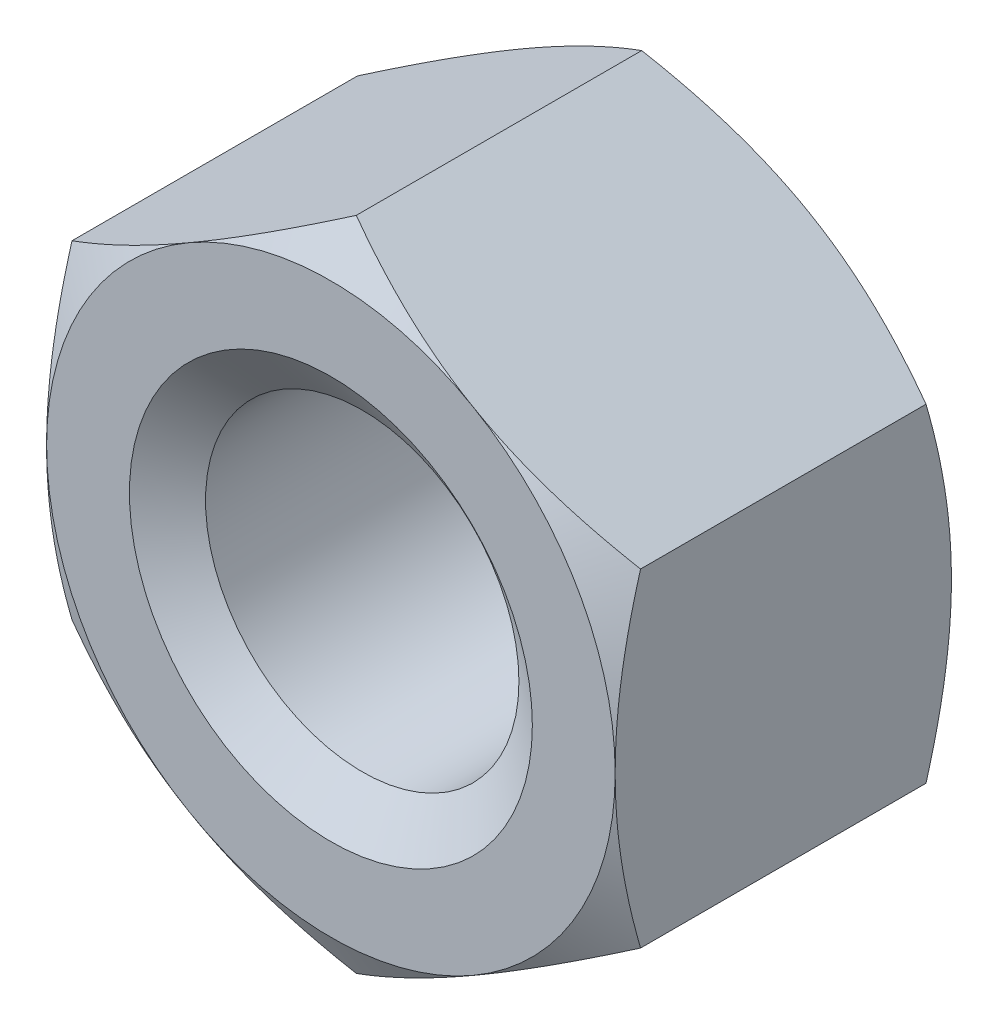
ISO-10303-21;
HEADER;
FILE_DESCRIPTION(('STEP AP214'),'2;1');
FILE_NAME('part.step','',(''),(''),'','','');
FILE_SCHEMA(('AUTOMOTIVE_DESIGN { 1 0 10303 214 1 1 1 1 }'));
ENDSEC;
DATA;
#1=APPLICATION_CONTEXT('core data for automotive mechanical design processes');
#2=APPLICATION_PROTOCOL_DEFINITION('international standard','automotive_design',2000,#1);
#3=PRODUCT_CONTEXT('',#1,'mechanical');
#4=PRODUCT('Part','Part','',(#3));
#5=PRODUCT_RELATED_PRODUCT_CATEGORY('part','',(#4));
#6=PRODUCT_DEFINITION_FORMATION('','',#4);
#7=PRODUCT_DEFINITION_CONTEXT('part definition',#1,'design');
#8=PRODUCT_DEFINITION('design','',#6,#7);
#9=PRODUCT_DEFINITION_SHAPE('','',#8);
#10=(LENGTH_UNIT() NAMED_UNIT(*) SI_UNIT(.MILLI.,.METRE.));
#11=(NAMED_UNIT(*) PLANE_ANGLE_UNIT() SI_UNIT($,.RADIAN.));
#12=(NAMED_UNIT(*) SI_UNIT($,.STERADIAN.) SOLID_ANGLE_UNIT());
#13=UNCERTAINTY_MEASURE_WITH_UNIT(LENGTH_MEASURE(1.E-05),#10,'distance_accuracy_value','');
#14=(GEOMETRIC_REPRESENTATION_CONTEXT(3) GLOBAL_UNCERTAINTY_ASSIGNED_CONTEXT((#13)) GLOBAL_UNIT_ASSIGNED_CONTEXT((#10,
#11,#12)) REPRESENTATION_CONTEXT('',''));
#15=CARTESIAN_POINT('',(0.,0.,0.));
#16=DIRECTION('',(0.,0.,1.));
#17=DIRECTION('',(1.,0.,0.));
#18=AXIS2_PLACEMENT_3D('',#15,#16,#17);
#19=CARTESIAN_POINT('',(0.,0.,-22.5298));
#20=DIRECTION('',(0.,0.,1.));
#21=DIRECTION('',(1.,0.,0.));
#22=AXIS2_PLACEMENT_3D('',#19,#20,#21);
#23=CYLINDRICAL_SURFACE('',#22,10.5);
#24=CARTESIAN_POINT('',(0.,0.,-2.10062261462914));
#25=DIRECTION('',(0.,0.,1.));
#26=DIRECTION('',(1.,0.,0.));
#27=AXIS2_PLACEMENT_3D('',#24,#25,#26);
#28=CIRCLE('',#27,10.5);
#29=CARTESIAN_POINT('',(10.5,0.,-2.10062261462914));
#30=VERTEX_POINT('',#29);
#31=EDGE_CURVE('E158',#30,#30,#28,.F.);
#32=ORIENTED_EDGE('',*,*,#31,.F.);
#33=EDGE_LOOP('',(#32));
#34=FACE_BOUND('',#33,.T.);
#35=CARTESIAN_POINT('',(0.,0.,-20.4037773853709));
#36=DIRECTION('',(0.,0.,-1.));
#37=DIRECTION('',(-1.,0.,0.));
#38=AXIS2_PLACEMENT_3D('',#35,#36,#37);
#39=CIRCLE('',#38,10.5);
#40=CARTESIAN_POINT('',(-10.5,0.,-20.4037773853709));
#41=VERTEX_POINT('',#40);
#42=EDGE_CURVE('E49',#41,#41,#39,.F.);
#43=ORIENTED_EDGE('',*,*,#42,.F.);
#44=EDGE_LOOP('',(#43));
#45=FACE_BOUND('',#44,.T.);
#46=ADVANCED_FACE('F44',(#34,#45),#23,.F.);
#47=CARTESIAN_POINT('',(0.,21.9970452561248,-22.5298));
#48=DIRECTION('',(-0.500000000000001,0.866025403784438,0.));
#49=DIRECTION('',(-0.866025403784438,-0.500000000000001,0.));
#50=AXIS2_PLACEMENT_3D('',#47,#48,#49);
#51=PLANE('',#50);
#52=DIRECTION('',(0.,0.,1.));
#53=VECTOR('',#52,1.);
#54=CARTESIAN_POINT('',(-19.05,10.9985226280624,-22.5298));
#55=LINE('',#54,#53);
#56=CARTESIAN_POINT('',(-19.05,10.9985226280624,-20.8283226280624));
#57=VERTEX_POINT('',#56);
#58=CARTESIAN_POINT('',(-19.05,10.9985226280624,-1.70147737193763));
#59=VERTEX_POINT('',#58);
#60=EDGE_CURVE('E277',#57,#59,#55,.T.);
#61=ORIENTED_EDGE('',*,*,#60,.T.);
#62=CARTESIAN_POINT('',(-19.0502,10.9984071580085,-1.70154403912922));
#63=CARTESIAN_POINT('',(-18.6314889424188,11.2401500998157,-1.56198341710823));
#64=CARTESIAN_POINT('',(-18.2111446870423,11.4828359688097,-1.42875584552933));
#65=CARTESIAN_POINT('',(-17.3670855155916,11.9701537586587,-1.17672716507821));
#66=CARTESIAN_POINT('',(-16.9433695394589,12.2147862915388,-1.05793080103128));
#67=CARTESIAN_POINT('',(-16.0917480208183,12.7064702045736,-0.836361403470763));
#68=CARTESIAN_POINT('',(-15.6638350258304,12.9535258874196,-0.733626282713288));
#69=CARTESIAN_POINT('',(-14.8050356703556,13.4493539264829,-0.546385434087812));
#70=CARTESIAN_POINT('',(-14.374149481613,13.6981261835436,-0.461878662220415));
#71=CARTESIAN_POINT('',(-13.5204444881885,14.1910129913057,-0.314688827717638));
#72=CARTESIAN_POINT('',(-13.0976890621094,14.4350909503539,-0.2515185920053));
#73=CARTESIAN_POINT('',(-12.250241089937,14.9243652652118,-0.145596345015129));
#74=CARTESIAN_POINT('',(-11.8255485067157,15.1695616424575,-0.102844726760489));
#75=CARTESIAN_POINT('',(-10.9754499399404,15.6603662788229,-0.0388391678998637));
#76=CARTESIAN_POINT('',(-10.5500454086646,15.9059736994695,-0.0175596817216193));
#77=CARTESIAN_POINT('',(-9.6988436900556,16.397415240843,0.00304398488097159));
#78=CARTESIAN_POINT('',(-9.27304651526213,16.6432493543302,0.00236884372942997));
#79=CARTESIAN_POINT('',(-8.47700964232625,17.1028414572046,-0.0194033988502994));
#80=CARTESIAN_POINT('',(-8.10671322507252,17.316632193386,-0.0378455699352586));
#81=CARTESIAN_POINT('',(-7.36700369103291,17.7437036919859,-0.0909844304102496));
#82=CARTESIAN_POINT('',(-6.99759056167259,17.9569844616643,-0.125680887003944));
#83=CARTESIAN_POINT('',(-6.25978756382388,18.3829552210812,-0.210726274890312));
#84=CARTESIAN_POINT('',(-5.89139892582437,18.5956445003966,-0.261089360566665));
#85=CARTESIAN_POINT('',(-5.15637533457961,19.0200105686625,-0.376579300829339));
#86=CARTESIAN_POINT('',(-4.78974037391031,19.2316873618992,-0.441706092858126));
#87=CARTESIAN_POINT('',(-3.6767727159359,19.8742595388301,-0.660888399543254));
#88=CARTESIAN_POINT('',(-2.93366305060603,20.3032941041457,-0.836799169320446));
#89=CARTESIAN_POINT('',(-1.45852420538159,21.1549659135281,-1.23604434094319));
#90=CARTESIAN_POINT('',(-0.726476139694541,21.5776140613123,-1.45928498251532));
#91=CARTESIAN_POINT('',(0.000199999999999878,21.9971607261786,-1.70154403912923));
#92=B_SPLINE_CURVE_WITH_KNOTS('',3,(#62,#63,#64,#65,#66,#67,#68,#69,#70,#71,#72,#73,#74,#75,#76,
#77,#78,#79,#80,#81,#82,#83,#84,#85,#86,#87,#88,#89,#90,#91),.UNSPECIFIED.,.F.,.F.,(4,2,2,2,2,2,
2,2,2,2,2,2,2,2,4),(0.,1.50971559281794,3.01992622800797,4.53364959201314,6.04728623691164,
7.52356313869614,8.99986845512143,10.4744153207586,11.9489166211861,13.2325441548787,
14.5161533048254,15.8009255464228,17.085692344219,19.7118183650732,22.3327898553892),.UNSPECIFIED.);
#93=CARTESIAN_POINT('',(-9.52500000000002,16.4977839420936,0.));
#94=VERTEX_POINT('',#93);
#95=EDGE_CURVE('E75',#59,#94,#92,.T.);
#96=ORIENTED_EDGE('',*,*,#95,.T.);
#97=CARTESIAN_POINT('',(0.,21.9970452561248,-1.70147737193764));
#98=VERTEX_POINT('',#97);
#99=EDGE_CURVE('E153',#94,#98,#92,.T.);
#100=ORIENTED_EDGE('',*,*,#99,.T.);
#101=DIRECTION('',(0.,0.,1.));
#102=VECTOR('',#101,1.);
#103=CARTESIAN_POINT('',(0.,21.9970452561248,-22.5298));
#104=LINE('',#103,#102);
#105=CARTESIAN_POINT('',(0.,21.9970452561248,-20.8283226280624));
#106=VERTEX_POINT('',#105);
#107=EDGE_CURVE('E164',#106,#98,#104,.T.);
#108=ORIENTED_EDGE('',*,*,#107,.F.);
#109=CARTESIAN_POINT('',(-19.0502,10.9984071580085,-20.8282559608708));
#110=CARTESIAN_POINT('',(-18.6314889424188,11.2401500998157,-20.9678165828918));
#111=CARTESIAN_POINT('',(-18.2111446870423,11.4828359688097,-21.1010441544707));
#112=CARTESIAN_POINT('',(-17.3670855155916,11.9701537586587,-21.3530728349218));
#113=CARTESIAN_POINT('',(-16.9433695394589,12.2147862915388,-21.4718691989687));
#114=CARTESIAN_POINT('',(-16.0917480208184,12.7064702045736,-21.6934385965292));
#115=CARTESIAN_POINT('',(-15.6638350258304,12.9535258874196,-21.7961737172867));
#116=CARTESIAN_POINT('',(-14.8050356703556,13.4493539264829,-21.9834145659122));
#117=CARTESIAN_POINT('',(-14.374149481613,13.6981261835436,-22.0679213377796));
#118=CARTESIAN_POINT('',(-13.5204444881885,14.1910129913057,-22.2151111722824));
#119=CARTESIAN_POINT('',(-13.0976890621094,14.4350909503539,-22.2782814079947));
#120=CARTESIAN_POINT('',(-12.250241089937,14.9243652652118,-22.3842036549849));
#121=CARTESIAN_POINT('',(-11.8255485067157,15.1695616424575,-22.4269552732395));
#122=CARTESIAN_POINT('',(-10.9754499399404,15.6603662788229,-22.4909608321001));
#123=CARTESIAN_POINT('',(-10.5500454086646,15.9059736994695,-22.5122403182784));
#124=CARTESIAN_POINT('',(-9.6988436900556,16.397415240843,-22.532843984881));
#125=CARTESIAN_POINT('',(-9.27304651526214,16.6432493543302,-22.5321688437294));
#126=CARTESIAN_POINT('',(-8.47700964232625,17.1028414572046,-22.5103966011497));
#127=CARTESIAN_POINT('',(-8.10671322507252,17.316632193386,-22.4919544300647));
#128=CARTESIAN_POINT('',(-7.3670036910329,17.7437036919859,-22.4388155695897));
#129=CARTESIAN_POINT('',(-6.99759056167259,17.9569844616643,-22.4041191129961));
#130=CARTESIAN_POINT('',(-6.25978756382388,18.3829552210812,-22.3190737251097));
#131=CARTESIAN_POINT('',(-5.89139892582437,18.5956445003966,-22.2687106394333));
#132=CARTESIAN_POINT('',(-5.15637533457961,19.0200105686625,-22.1532206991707));
#133=CARTESIAN_POINT('',(-4.78974037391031,19.2316873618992,-22.0880939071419));
#134=CARTESIAN_POINT('',(-3.67677271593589,19.8742595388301,-21.8689116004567));
#135=CARTESIAN_POINT('',(-2.93366305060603,20.3032941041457,-21.6930008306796));
#136=CARTESIAN_POINT('',(-1.45852420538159,21.1549659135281,-21.2937556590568));
#137=CARTESIAN_POINT('',(-0.72647613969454,21.5776140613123,-21.0705150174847));
#138=CARTESIAN_POINT('',(0.000199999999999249,21.9971607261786,-20.8282559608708));
#139=B_SPLINE_CURVE_WITH_KNOTS('',3,(#109,#110,#111,#112,#113,#114,#115,#116,#117,#118,#119,
#120,#121,#122,#123,#124,#125,#126,#127,#128,#129,#130,#131,#132,#133,#134,#135,#136,#137,#138),
.UNSPECIFIED.,.F.,.F.,(4,2,2,2,2,2,2,2,2,2,2,2,2,2,4),(0.,1.50971559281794,3.01992622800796,
4.53364959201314,6.04728623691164,7.52356313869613,8.99986845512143,10.4744153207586,
11.9489166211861,13.2325441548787,14.5161533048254,15.8009255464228,17.085692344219,
19.7118183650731,22.3327898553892),.UNSPECIFIED.);
#140=CARTESIAN_POINT('',(-9.52500000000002,16.4977839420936,-22.5298));
#141=VERTEX_POINT('',#140);
#142=EDGE_CURVE('E259',#141,#106,#139,.T.);
#143=ORIENTED_EDGE('',*,*,#142,.F.);
#144=EDGE_CURVE('E243',#57,#141,#139,.T.);
#145=ORIENTED_EDGE('',*,*,#144,.F.);
#146=EDGE_LOOP('',(#61,#96,#100,#108,#143,#145));
#147=FACE_BOUND('',#146,.T.);
#148=ADVANCED_FACE('F50',(#147),#51,.T.);
#149=CARTESIAN_POINT('',(19.05,10.9985226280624,-22.5298));
#150=DIRECTION('',(0.500000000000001,0.866025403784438,0.));
#151=DIRECTION('',(-0.866025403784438,0.500000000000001,0.));
#152=AXIS2_PLACEMENT_3D('',#149,#150,#151);
#153=PLANE('',#152);
#154=ORIENTED_EDGE('',*,*,#107,.T.);
#155=CARTESIAN_POINT('',(-0.000200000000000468,21.9971607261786,-1.70154403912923));
#156=CARTESIAN_POINT('',(0.418511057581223,21.7554177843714,-1.56198341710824));
#157=CARTESIAN_POINT('',(0.83885531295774,21.5127319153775,-1.42875584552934));
#158=CARTESIAN_POINT('',(1.68291448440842,21.0254141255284,-1.17672716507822));
#159=CARTESIAN_POINT('',(2.10663046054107,20.7807815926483,-1.05793080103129));
#160=CARTESIAN_POINT('',(2.95825197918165,20.2890976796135,-0.836361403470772));
#161=CARTESIAN_POINT('',(3.38616497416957,20.0420419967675,-0.733626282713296));
#162=CARTESIAN_POINT('',(4.24496432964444,19.5462139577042,-0.546385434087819));
#163=CARTESIAN_POINT('',(4.67585051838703,19.2974417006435,-0.461878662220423));
#164=CARTESIAN_POINT('',(5.52955551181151,18.8045548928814,-0.314688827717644));
#165=CARTESIAN_POINT('',(5.95231093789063,18.5604769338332,-0.251518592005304));
#166=CARTESIAN_POINT('',(6.79975891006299,18.0712026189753,-0.145596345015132));
#167=CARTESIAN_POINT('',(7.22445149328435,17.8260062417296,-0.102844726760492));
#168=CARTESIAN_POINT('',(8.07455006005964,17.3352016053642,-0.0388391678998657));
#169=CARTESIAN_POINT('',(8.49995459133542,17.0895941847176,-0.0175596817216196));
#170=CARTESIAN_POINT('',(9.35115630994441,16.5981526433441,0.00304398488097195));
#171=CARTESIAN_POINT('',(9.77695348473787,16.3523185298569,0.00236884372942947));
#172=CARTESIAN_POINT('',(10.5729903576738,15.8927264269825,-0.019403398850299));
#173=CARTESIAN_POINT('',(10.9432867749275,15.6789356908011,-0.0378455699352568));
#174=CARTESIAN_POINT('',(11.6829963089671,15.2518641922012,-0.0909844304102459));
#175=CARTESIAN_POINT('',(12.0524094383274,15.0385834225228,-0.12568088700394));
#176=CARTESIAN_POINT('',(12.7902124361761,14.612612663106,-0.210726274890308));
#177=CARTESIAN_POINT('',(13.1586010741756,14.3999233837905,-0.261089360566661));
#178=CARTESIAN_POINT('',(13.8936246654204,13.9755573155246,-0.376579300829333));
#179=CARTESIAN_POINT('',(14.2602596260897,13.7638805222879,-0.441706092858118));
#180=CARTESIAN_POINT('',(15.3732272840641,13.121308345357,-0.660888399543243));
#181=CARTESIAN_POINT('',(16.116336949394,12.6922737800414,-0.836799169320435));
#182=CARTESIAN_POINT('',(17.5914757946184,11.840601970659,-1.23604434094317));
#183=CARTESIAN_POINT('',(18.3235238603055,11.4179538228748,-1.45928498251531));
#184=CARTESIAN_POINT('',(19.0502,10.9984071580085,-1.70154403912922));
#185=B_SPLINE_CURVE_WITH_KNOTS('',3,(#155,#156,#157,#158,#159,#160,#161,#162,#163,#164,#165,
#166,#167,#168,#169,#170,#171,#172,#173,#174,#175,#176,#177,#178,#179,#180,#181,#182,#183,#184),
.UNSPECIFIED.,.F.,.F.,(4,2,2,2,2,2,2,2,2,2,2,2,2,2,4),(0.,1.50971559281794,3.01992622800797,
4.53364959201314,6.04728623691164,7.52356313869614,8.99986845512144,10.4744153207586,
11.9489166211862,13.2325441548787,14.5161533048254,15.8009255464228,17.085692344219,
19.7118183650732,22.3327898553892),.UNSPECIFIED.);
#186=CARTESIAN_POINT('',(9.52500000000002,16.4977839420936,0.));
#187=VERTEX_POINT('',#186);
#188=EDGE_CURVE('E148',#98,#187,#185,.T.);
#189=ORIENTED_EDGE('',*,*,#188,.T.);
#190=CARTESIAN_POINT('',(19.05,10.9985226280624,-1.70147737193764));
#191=VERTEX_POINT('',#190);
#192=EDGE_CURVE('E140',#187,#191,#185,.T.);
#193=ORIENTED_EDGE('',*,*,#192,.T.);
#194=DIRECTION('',(0.,0.,1.));
#195=VECTOR('',#194,1.);
#196=CARTESIAN_POINT('',(19.05,10.9985226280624,-22.5298));
#197=LINE('',#196,#195);
#198=CARTESIAN_POINT('',(19.05,10.9985226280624,-20.8283226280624));
#199=VERTEX_POINT('',#198);
#200=EDGE_CURVE('E270',#199,#191,#197,.T.);
#201=ORIENTED_EDGE('',*,*,#200,.F.);
#202=CARTESIAN_POINT('',(-0.000200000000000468,21.9971607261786,-20.8282559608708));
#203=CARTESIAN_POINT('',(0.418511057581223,21.7554177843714,-20.9678165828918));
#204=CARTESIAN_POINT('',(0.83885531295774,21.5127319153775,-21.1010441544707));
#205=CARTESIAN_POINT('',(1.68291448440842,21.0254141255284,-21.3530728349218));
#206=CARTESIAN_POINT('',(2.10663046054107,20.7807815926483,-21.4718691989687));
#207=CARTESIAN_POINT('',(2.95825197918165,20.2890976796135,-21.6934385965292));
#208=CARTESIAN_POINT('',(3.38616497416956,20.0420419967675,-21.7961737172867));
#209=CARTESIAN_POINT('',(4.24496432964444,19.5462139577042,-21.9834145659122));
#210=CARTESIAN_POINT('',(4.67585051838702,19.2974417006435,-22.0679213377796));
#211=CARTESIAN_POINT('',(5.52955551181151,18.8045548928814,-22.2151111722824));
#212=CARTESIAN_POINT('',(5.95231093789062,18.5604769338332,-22.2782814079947));
#213=CARTESIAN_POINT('',(6.79975891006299,18.0712026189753,-22.3842036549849));
#214=CARTESIAN_POINT('',(7.22445149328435,17.8260062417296,-22.4269552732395));
#215=CARTESIAN_POINT('',(8.07455006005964,17.3352016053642,-22.4909608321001));
#216=CARTESIAN_POINT('',(8.49995459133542,17.0895941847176,-22.5122403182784));
#217=CARTESIAN_POINT('',(9.3511563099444,16.5981526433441,-22.532843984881));
#218=CARTESIAN_POINT('',(9.77695348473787,16.3523185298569,-22.5321688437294));
#219=CARTESIAN_POINT('',(10.5729903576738,15.8927264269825,-22.5103966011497));
#220=CARTESIAN_POINT('',(10.9432867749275,15.6789356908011,-22.4919544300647));
#221=CARTESIAN_POINT('',(11.6829963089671,15.2518641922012,-22.4388155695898));
#222=CARTESIAN_POINT('',(12.0524094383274,15.0385834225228,-22.4041191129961));
#223=CARTESIAN_POINT('',(12.7902124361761,14.612612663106,-22.3190737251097));
#224=CARTESIAN_POINT('',(13.1586010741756,14.3999233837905,-22.2687106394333));
#225=CARTESIAN_POINT('',(13.8936246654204,13.9755573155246,-22.1532206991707));
#226=CARTESIAN_POINT('',(14.2602596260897,13.7638805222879,-22.0880939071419));
#227=CARTESIAN_POINT('',(15.3732272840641,13.121308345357,-21.8689116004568));
#228=CARTESIAN_POINT('',(16.116336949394,12.6922737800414,-21.6930008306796));
#229=CARTESIAN_POINT('',(17.5914757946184,11.840601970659,-21.2937556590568));
#230=CARTESIAN_POINT('',(18.3235238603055,11.4179538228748,-21.0705150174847));
#231=CARTESIAN_POINT('',(19.0502,10.9984071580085,-20.8282559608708));
#232=B_SPLINE_CURVE_WITH_KNOTS('',3,(#202,#203,#204,#205,#206,#207,#208,#209,#210,#211,#212,
#213,#214,#215,#216,#217,#218,#219,#220,#221,#222,#223,#224,#225,#226,#227,#228,#229,#230,#231),
.UNSPECIFIED.,.F.,.F.,(4,2,2,2,2,2,2,2,2,2,2,2,2,2,4),(0.,1.50971559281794,3.01992622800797,
4.53364959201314,6.04728623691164,7.52356313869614,8.99986845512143,10.4744153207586,
11.9489166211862,13.2325441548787,14.5161533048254,15.8009255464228,17.085692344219,
19.7118183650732,22.3327898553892),.UNSPECIFIED.);
#233=CARTESIAN_POINT('',(9.52500000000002,16.4977839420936,-22.5298));
#234=VERTEX_POINT('',#233);
#235=EDGE_CURVE('E257',#234,#199,#232,.T.);
#236=ORIENTED_EDGE('',*,*,#235,.F.);
#237=EDGE_CURVE('E265',#106,#234,#232,.T.);
#238=ORIENTED_EDGE('',*,*,#237,.F.);
#239=EDGE_LOOP('',(#154,#189,#193,#201,#236,#238));
#240=FACE_BOUND('',#239,.T.);
#241=ADVANCED_FACE('F162',(#240),#153,.T.);
#242=CARTESIAN_POINT('',(19.05,10.9985226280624,-22.5298));
#243=DIRECTION('',(-1.,0.,0.));
#244=DIRECTION('',(0.,0.,1.));
#245=AXIS2_PLACEMENT_3D('',#242,#243,#244);
#246=PLANE('',#245);
#247=CARTESIAN_POINT('',(19.05,-29.169702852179,-9.11593373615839));
#248=CARTESIAN_POINT('',(19.05,-28.7515170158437,-8.91378890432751));
#249=CARTESIAN_POINT('',(19.05,-28.3328257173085,-8.71269026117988));
#250=CARTESIAN_POINT('',(19.05,-27.494325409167,-8.31282549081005));
#251=CARTESIAN_POINT('',(19.05,-27.0745163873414,-8.11405938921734));
#252=CARTESIAN_POINT('',(19.05,-25.813129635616,-7.52156252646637));
#253=CARTESIAN_POINT('',(19.05,-24.9697281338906,-7.13169909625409));
#254=CARTESIAN_POINT('',(19.05,-23.2722707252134,-6.36257122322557));
#255=CARTESIAN_POINT('',(19.05,-22.4181814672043,-5.98338020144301));
#256=CARTESIAN_POINT('',(19.05,-20.7029839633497,-5.24127883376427));
#257=CARTESIAN_POINT('',(19.05,-19.8418760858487,-4.87836763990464));
#258=CARTESIAN_POINT('',(19.05,-18.1005821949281,-4.1688569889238));
#259=CARTESIAN_POINT('',(19.05,-17.2202917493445,-3.82251248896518));
#260=CARTESIAN_POINT('',(19.05,-15.4493217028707,-3.15694792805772));
#261=CARTESIAN_POINT('',(19.05,-14.5586409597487,-2.83773088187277));
#262=CARTESIAN_POINT('',(19.05,-12.7673320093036,-2.2350028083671));
#263=CARTESIAN_POINT('',(19.05,-11.8667295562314,-1.95141586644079));
#264=CARTESIAN_POINT('',(19.05,-10.0526343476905,-1.42914392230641));
#265=CARTESIAN_POINT('',(19.05,-9.13914576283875,-1.19044473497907));
#266=CARTESIAN_POINT('',(19.05,-7.7590746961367,-0.874799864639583));
#267=CARTESIAN_POINT('',(19.05,-7.29731333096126,-0.776636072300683));
#268=CARTESIAN_POINT('',(19.05,-6.37071732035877,-0.595993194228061));
#269=CARTESIAN_POINT('',(19.05,-5.90588274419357,-0.513513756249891));
#270=CARTESIAN_POINT('',(19.05,-4.97345228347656,-0.36570182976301));
#271=CARTESIAN_POINT('',(19.05,-4.50585623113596,-0.30037039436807));
#272=CARTESIAN_POINT('',(19.05,-3.56843861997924,-0.188166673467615));
#273=CARTESIAN_POINT('',(19.05,-3.09861705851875,-0.141294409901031));
#274=CARTESIAN_POINT('',(19.05,-2.16041609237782,-0.0672708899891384));
#275=CARTESIAN_POINT('',(19.05,-1.69204648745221,-0.039996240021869));
#276=CARTESIAN_POINT('',(19.05,-0.754574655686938,-0.00531133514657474));
#277=CARTESIAN_POINT('',(19.05,-0.285472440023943,0.00209921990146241));
#278=CARTESIAN_POINT('',(19.05,0.6524929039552,-0.00311981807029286));
#279=CARTESIAN_POINT('',(19.05,1.12135606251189,-0.015743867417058));
#280=CARTESIAN_POINT('',(19.05,2.05813737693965,-0.0607182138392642));
#281=CARTESIAN_POINT('',(19.05,2.52605549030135,-0.0930693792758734));
#282=CARTESIAN_POINT('',(19.05,3.65980250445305,-0.194680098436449));
#283=CARTESIAN_POINT('',(19.05,4.32476458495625,-0.273803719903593));
#284=CARTESIAN_POINT('',(19.05,5.64947952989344,-0.467485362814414));
#285=CARTESIAN_POINT('',(19.05,6.30923160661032,-0.582048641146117));
#286=CARTESIAN_POINT('',(19.05,8.2818238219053,-0.973151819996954));
#287=CARTESIAN_POINT('',(19.05,9.58542312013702,-1.29684470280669));
#288=CARTESIAN_POINT('',(19.05,11.5353898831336,-1.85499845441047));
#289=CARTESIAN_POINT('',(19.05,12.191945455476,-2.05588340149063));
#290=CARTESIAN_POINT('',(19.05,13.498713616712,-2.47768236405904));
#291=CARTESIAN_POINT('',(19.05,14.1489256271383,-2.69859818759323));
#292=CARTESIAN_POINT('',(19.05,15.4397656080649,-3.15575174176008));
#293=CARTESIAN_POINT('',(19.05,16.0804269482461,-3.39189604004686));
#294=CARTESIAN_POINT('',(19.05,17.0373840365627,-3.75633654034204));
#295=CARTESIAN_POINT('',(19.05,17.3556458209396,-3.87949985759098));
#296=CARTESIAN_POINT('',(19.05,17.9909330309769,-4.12895791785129));
#297=CARTESIAN_POINT('',(19.05,18.3079584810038,-4.25525259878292));
#298=CARTESIAN_POINT('',(19.05,18.6244086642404,-4.38297164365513));
#299=B_SPLINE_CURVE_WITH_KNOTS('',3,(#247,#248,#249,#250,#251,#252,#253,#254,#255,#256,#257,
#258,#259,#260,#261,#262,#263,#264,#265,#266,#267,#268,#269,#270,#271,#272,#273,#274,#275,#276,
#277,#278,#279,#280,#281,#282,#283,#284,#285,#286,#287,#288,#289,#290,#291,#292,#293,#294,#295,
#296,#297,#298),.UNSPECIFIED.,.F.,.F.,(4,2,2,2,2,2,2,2,2,2,2,2,2,2,2,2,2,2,2,2,2,2,2,2,2,4),(0.,
1.39343811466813,2.78689152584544,5.57425145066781,8.37756231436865,11.1807269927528,
14.0183059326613,16.856199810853,19.6879407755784,22.5187853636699,23.934802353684,
25.3507875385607,26.766859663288,28.1829334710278,29.5900111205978,30.9970675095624,
32.4037346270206,33.8104636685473,35.8182820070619,37.8263983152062,41.8503661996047,
43.9100054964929,45.9698308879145,48.0180400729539,49.0418117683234,50.0655631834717),.UNSPECIFIED.);
#300=CARTESIAN_POINT('',(19.05,-10.9985226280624,-1.70147737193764));
#301=VERTEX_POINT('',#300);
#302=CARTESIAN_POINT('',(19.05,0.,0.));
#303=VERTEX_POINT('',#302);
#304=EDGE_CURVE('E221',#301,#303,#299,.T.);
#305=ORIENTED_EDGE('',*,*,#304,.F.);
#306=DIRECTION('',(0.,0.,1.));
#307=VECTOR('',#306,1.);
#308=CARTESIAN_POINT('',(19.05,-10.9985226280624,-22.5298));
#309=LINE('',#308,#307);
#310=CARTESIAN_POINT('',(19.05,-10.9985226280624,-20.8283226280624));
#311=VERTEX_POINT('',#310);
#312=EDGE_CURVE('E268',#311,#301,#309,.T.);
#313=ORIENTED_EDGE('',*,*,#312,.F.);
#314=CARTESIAN_POINT('',(19.05,-29.169702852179,-13.4138662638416));
#315=CARTESIAN_POINT('',(19.05,-28.7515170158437,-13.6160110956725));
#316=CARTESIAN_POINT('',(19.05,-28.3328257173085,-13.8171097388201));
#317=CARTESIAN_POINT('',(19.05,-27.494325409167,-14.21697450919));
#318=CARTESIAN_POINT('',(19.05,-27.0745163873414,-14.4157406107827));
#319=CARTESIAN_POINT('',(19.05,-25.813129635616,-15.0082374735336));
#320=CARTESIAN_POINT('',(19.05,-24.9697281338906,-15.3981009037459));
#321=CARTESIAN_POINT('',(19.05,-23.2722707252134,-16.1672287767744));
#322=CARTESIAN_POINT('',(19.05,-22.4181814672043,-16.546419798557));
#323=CARTESIAN_POINT('',(19.05,-20.7029839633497,-17.2885211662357));
#324=CARTESIAN_POINT('',(19.05,-19.8418760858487,-17.6514323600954));
#325=CARTESIAN_POINT('',(19.05,-18.1005821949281,-18.3609430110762));
#326=CARTESIAN_POINT('',(19.05,-17.2202917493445,-18.7072875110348));
#327=CARTESIAN_POINT('',(19.05,-15.4493217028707,-19.3728520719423));
#328=CARTESIAN_POINT('',(19.05,-14.5586409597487,-19.6920691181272));
#329=CARTESIAN_POINT('',(19.05,-12.7673320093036,-20.2947971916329));
#330=CARTESIAN_POINT('',(19.05,-11.8667295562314,-20.5783841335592));
#331=CARTESIAN_POINT('',(19.05,-10.0526343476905,-21.1006560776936));
#332=CARTESIAN_POINT('',(19.05,-9.13914576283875,-21.3393552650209));
#333=CARTESIAN_POINT('',(19.05,-7.7590746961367,-21.6550001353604));
#334=CARTESIAN_POINT('',(19.05,-7.29731333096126,-21.7531639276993));
#335=CARTESIAN_POINT('',(19.05,-6.37071732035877,-21.9338068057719));
#336=CARTESIAN_POINT('',(19.05,-5.90588274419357,-22.0162862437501));
#337=CARTESIAN_POINT('',(19.05,-4.97345228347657,-22.164098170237));
#338=CARTESIAN_POINT('',(19.05,-4.50585623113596,-22.2294296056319));
#339=CARTESIAN_POINT('',(19.05,-3.56843861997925,-22.3416333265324));
#340=CARTESIAN_POINT('',(19.05,-3.09861705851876,-22.388505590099));
#341=CARTESIAN_POINT('',(19.05,-2.16041609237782,-22.4625291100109));
#342=CARTESIAN_POINT('',(19.05,-1.69204648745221,-22.4898037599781));
#343=CARTESIAN_POINT('',(19.05,-0.754574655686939,-22.5244886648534));
#344=CARTESIAN_POINT('',(19.05,-0.285472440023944,-22.5318992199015));
#345=CARTESIAN_POINT('',(19.05,0.652492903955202,-22.5266801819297));
#346=CARTESIAN_POINT('',(19.05,1.12135606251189,-22.5140561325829));
#347=CARTESIAN_POINT('',(19.05,2.05813737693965,-22.4690817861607));
#348=CARTESIAN_POINT('',(19.05,2.52605549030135,-22.4367306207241));
#349=CARTESIAN_POINT('',(19.05,3.65980250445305,-22.3351199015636));
#350=CARTESIAN_POINT('',(19.05,4.32476458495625,-22.2559962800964));
#351=CARTESIAN_POINT('',(19.05,5.64947952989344,-22.0623146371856));
#352=CARTESIAN_POINT('',(19.05,6.30923160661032,-21.9477513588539));
#353=CARTESIAN_POINT('',(19.05,8.2818238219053,-21.556648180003));
#354=CARTESIAN_POINT('',(19.05,9.58542312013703,-21.2329552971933));
#355=CARTESIAN_POINT('',(19.05,11.5353898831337,-20.6748015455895));
#356=CARTESIAN_POINT('',(19.05,12.191945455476,-20.4739165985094));
#357=CARTESIAN_POINT('',(19.05,13.498713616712,-20.052117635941));
#358=CARTESIAN_POINT('',(19.05,14.1489256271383,-19.8312018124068));
#359=CARTESIAN_POINT('',(19.05,15.4397656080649,-19.3740482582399));
#360=CARTESIAN_POINT('',(19.05,16.0804269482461,-19.1379039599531));
#361=CARTESIAN_POINT('',(19.05,17.0373840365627,-18.773463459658));
#362=CARTESIAN_POINT('',(19.05,17.3556458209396,-18.650300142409));
#363=CARTESIAN_POINT('',(19.05,17.9909330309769,-18.4008420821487));
#364=CARTESIAN_POINT('',(19.05,18.3079584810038,-18.2745474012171));
#365=CARTESIAN_POINT('',(19.05,18.6244086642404,-18.1468283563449));
#366=B_SPLINE_CURVE_WITH_KNOTS('',3,(#314,#315,#316,#317,#318,#319,#320,#321,#322,#323,#324,
#325,#326,#327,#328,#329,#330,#331,#332,#333,#334,#335,#336,#337,#338,#339,#340,#341,#342,#343,
#344,#345,#346,#347,#348,#349,#350,#351,#352,#353,#354,#355,#356,#357,#358,#359,#360,#361,#362,
#363,#364,#365),.UNSPECIFIED.,.F.,.F.,(4,2,2,2,2,2,2,2,2,2,2,2,2,2,2,2,2,2,2,2,2,2,2,2,2,4),(0.,
1.39343811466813,2.78689152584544,5.57425145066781,8.37756231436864,11.1807269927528,
14.0183059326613,16.856199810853,19.6879407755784,22.5187853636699,23.934802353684,
25.3507875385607,26.766859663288,28.1829334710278,29.5900111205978,30.9970675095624,
32.4037346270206,33.8104636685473,35.8182820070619,37.8263983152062,41.8503661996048,
43.910005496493,45.9698308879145,48.0180400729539,49.0418117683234,50.0655631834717),.UNSPECIFIED.);
#367=CARTESIAN_POINT('',(19.05,0.,-22.5298));
#368=VERTEX_POINT('',#367);
#369=EDGE_CURVE('E232',#311,#368,#366,.T.);
#370=ORIENTED_EDGE('',*,*,#369,.T.);
#371=EDGE_CURVE('E244',#368,#199,#366,.T.);
#372=ORIENTED_EDGE('',*,*,#371,.T.);
#373=ORIENTED_EDGE('',*,*,#200,.T.);
#374=EDGE_CURVE('E142',#303,#191,#299,.T.);
#375=ORIENTED_EDGE('',*,*,#374,.F.);
#376=EDGE_LOOP('',(#305,#313,#370,#372,#373,#375));
#377=FACE_BOUND('',#376,.T.);
#378=ADVANCED_FACE('F227',(#377),#246,.F.);
#379=CARTESIAN_POINT('',(0.,-21.9970452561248,-22.5298));
#380=DIRECTION('',(0.500000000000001,-0.866025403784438,0.));
#381=DIRECTION('',(0.866025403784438,0.500000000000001,0.));
#382=AXIS2_PLACEMENT_3D('',#379,#380,#381);
#383=PLANE('',#382);
#384=ORIENTED_EDGE('',*,*,#312,.T.);
#385=CARTESIAN_POINT('',(19.0502,-10.9984071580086,-1.70154403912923));
#386=CARTESIAN_POINT('',(18.6314889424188,-11.2401500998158,-1.56198341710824));
#387=CARTESIAN_POINT('',(18.2111446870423,-11.4828359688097,-1.42875584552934));
#388=CARTESIAN_POINT('',(17.3670855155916,-11.9701537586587,-1.17672716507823));
#389=CARTESIAN_POINT('',(16.9433695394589,-12.2147862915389,-1.05793080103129));
#390=CARTESIAN_POINT('',(16.0917480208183,-12.7064702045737,-0.836361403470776));
#391=CARTESIAN_POINT('',(15.6638350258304,-12.9535258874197,-0.733626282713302));
#392=CARTESIAN_POINT('',(14.8050356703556,-13.449353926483,-0.546385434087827));
#393=CARTESIAN_POINT('',(14.374149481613,-13.6981261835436,-0.461878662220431));
#394=CARTESIAN_POINT('',(13.5204444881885,-14.1910129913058,-0.314688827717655));
#395=CARTESIAN_POINT('',(13.0976890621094,-14.4350909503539,-0.251518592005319));
#396=CARTESIAN_POINT('',(12.250241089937,-14.9243652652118,-0.14559634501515));
#397=CARTESIAN_POINT('',(11.8255485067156,-15.1695616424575,-0.102844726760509));
#398=CARTESIAN_POINT('',(10.9754499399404,-15.660366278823,-0.0388391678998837));
#399=CARTESIAN_POINT('',(10.5500454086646,-15.9059736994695,-0.0175596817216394));
#400=CARTESIAN_POINT('',(9.69884369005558,-16.3974152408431,0.00304398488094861));
#401=CARTESIAN_POINT('',(9.27304651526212,-16.6432493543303,0.00236884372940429));
#402=CARTESIAN_POINT('',(8.47700964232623,-17.1028414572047,-0.0194033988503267));
#403=CARTESIAN_POINT('',(8.10671322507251,-17.3166321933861,-0.0378455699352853));
#404=CARTESIAN_POINT('',(7.36700369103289,-17.743703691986,-0.0909844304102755));
#405=CARTESIAN_POINT('',(6.99759056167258,-17.9569844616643,-0.12568088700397));
#406=CARTESIAN_POINT('',(6.25978756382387,-18.3829552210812,-0.21072627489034));
#407=CARTESIAN_POINT('',(5.89139892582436,-18.5956445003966,-0.261089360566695));
#408=CARTESIAN_POINT('',(5.15637533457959,-19.0200105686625,-0.37657930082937));
#409=CARTESIAN_POINT('',(4.78974037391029,-19.2316873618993,-0.441706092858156));
#410=CARTESIAN_POINT('',(3.67677271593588,-19.8742595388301,-0.660888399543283));
#411=CARTESIAN_POINT('',(2.93366305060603,-20.3032941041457,-0.836799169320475));
#412=CARTESIAN_POINT('',(1.45852420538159,-21.1549659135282,-1.23604434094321));
#413=CARTESIAN_POINT('',(0.726476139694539,-21.5776140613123,-1.45928498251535));
#414=CARTESIAN_POINT('',(-0.000200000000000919,-21.9971607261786,-1.70154403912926));
#415=B_SPLINE_CURVE_WITH_KNOTS('',3,(#385,#386,#387,#388,#389,#390,#391,#392,#393,#394,#395,
#396,#397,#398,#399,#400,#401,#402,#403,#404,#405,#406,#407,#408,#409,#410,#411,#412,#413,#414),
.UNSPECIFIED.,.F.,.F.,(4,2,2,2,2,2,2,2,2,2,2,2,2,2,4),(0.,1.50971559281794,3.01992622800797,
4.53364959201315,6.04728623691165,7.52356313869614,8.99986845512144,10.4744153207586,
11.9489166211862,13.2325441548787,14.5161533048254,15.8009255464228,17.085692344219,
19.7118183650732,22.3327898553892),.UNSPECIFIED.);
#416=CARTESIAN_POINT('',(9.52500000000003,-16.4977839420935,0.));
#417=VERTEX_POINT('',#416);
#418=EDGE_CURVE('E228',#301,#417,#415,.T.);
#419=ORIENTED_EDGE('',*,*,#418,.T.);
#420=CARTESIAN_POINT('',(0.,-21.9970452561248,-1.70147737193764));
#421=VERTEX_POINT('',#420);
#422=EDGE_CURVE('E211',#417,#421,#415,.T.);
#423=ORIENTED_EDGE('',*,*,#422,.T.);
#424=DIRECTION('',(0.,0.,1.));
#425=VECTOR('',#424,1.);
#426=CARTESIAN_POINT('',(0.,-21.9970452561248,-22.5298));
#427=LINE('',#426,#425);
#428=CARTESIAN_POINT('',(0.,-21.9970452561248,-20.8283226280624));
#429=VERTEX_POINT('',#428);
#430=EDGE_CURVE('E275',#429,#421,#427,.T.);
#431=ORIENTED_EDGE('',*,*,#430,.F.);
#432=CARTESIAN_POINT('',(19.0502,-10.9984071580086,-20.8282559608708));
#433=CARTESIAN_POINT('',(18.6314889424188,-11.2401500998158,-20.9678165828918));
#434=CARTESIAN_POINT('',(18.2111446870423,-11.4828359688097,-21.1010441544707));
#435=CARTESIAN_POINT('',(17.3670855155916,-11.9701537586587,-21.3530728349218));
#436=CARTESIAN_POINT('',(16.9433695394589,-12.2147862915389,-21.4718691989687));
#437=CARTESIAN_POINT('',(16.0917480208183,-12.7064702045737,-21.6934385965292));
#438=CARTESIAN_POINT('',(15.6638350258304,-12.9535258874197,-21.7961737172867));
#439=CARTESIAN_POINT('',(14.8050356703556,-13.449353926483,-21.9834145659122));
#440=CARTESIAN_POINT('',(14.374149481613,-13.6981261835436,-22.0679213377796));
#441=CARTESIAN_POINT('',(13.5204444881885,-14.1910129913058,-22.2151111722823));
#442=CARTESIAN_POINT('',(13.0976890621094,-14.4350909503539,-22.2782814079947));
#443=CARTESIAN_POINT('',(12.250241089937,-14.9243652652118,-22.3842036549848));
#444=CARTESIAN_POINT('',(11.8255485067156,-15.1695616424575,-22.4269552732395));
#445=CARTESIAN_POINT('',(10.9754499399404,-15.660366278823,-22.4909608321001));
#446=CARTESIAN_POINT('',(10.5500454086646,-15.9059736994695,-22.5122403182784));
#447=CARTESIAN_POINT('',(9.69884369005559,-16.3974152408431,-22.5328439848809));
#448=CARTESIAN_POINT('',(9.27304651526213,-16.6432493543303,-22.5321688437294));
#449=CARTESIAN_POINT('',(8.47700964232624,-17.1028414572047,-22.5103966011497));
#450=CARTESIAN_POINT('',(8.10671322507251,-17.3166321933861,-22.4919544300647));
#451=CARTESIAN_POINT('',(7.3670036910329,-17.743703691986,-22.4388155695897));
#452=CARTESIAN_POINT('',(6.99759056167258,-17.9569844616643,-22.404119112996));
#453=CARTESIAN_POINT('',(6.25978756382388,-18.3829552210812,-22.3190737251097));
#454=CARTESIAN_POINT('',(5.89139892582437,-18.5956445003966,-22.2687106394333));
#455=CARTESIAN_POINT('',(5.1563753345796,-19.0200105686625,-22.1532206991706));
#456=CARTESIAN_POINT('',(4.7897403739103,-19.2316873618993,-22.0880939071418));
#457=CARTESIAN_POINT('',(3.67677271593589,-19.8742595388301,-21.8689116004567));
#458=CARTESIAN_POINT('',(2.93366305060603,-20.3032941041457,-21.6930008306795));
#459=CARTESIAN_POINT('',(1.45852420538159,-21.1549659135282,-21.2937556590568));
#460=CARTESIAN_POINT('',(0.726476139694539,-21.5776140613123,-21.0705150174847));
#461=CARTESIAN_POINT('',(-0.000200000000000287,-21.9971607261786,-20.8282559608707));
#462=B_SPLINE_CURVE_WITH_KNOTS('',3,(#432,#433,#434,#435,#436,#437,#438,#439,#440,#441,#442,
#443,#444,#445,#446,#447,#448,#449,#450,#451,#452,#453,#454,#455,#456,#457,#458,#459,#460,#461),
.UNSPECIFIED.,.F.,.F.,(4,2,2,2,2,2,2,2,2,2,2,2,2,2,4),(0.,1.50971559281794,3.01992622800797,
4.53364959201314,6.04728623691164,7.52356313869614,8.99986845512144,10.4744153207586,
11.9489166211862,13.2325441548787,14.5161533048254,15.8009255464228,17.085692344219,
19.7118183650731,22.3327898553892),.UNSPECIFIED.);
#463=CARTESIAN_POINT('',(9.52500000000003,-16.4977839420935,-22.5298));
#464=VERTEX_POINT('',#463);
#465=EDGE_CURVE('E246',#464,#429,#462,.T.);
#466=ORIENTED_EDGE('',*,*,#465,.F.);
#467=EDGE_CURVE('E242',#311,#464,#462,.T.);
#468=ORIENTED_EDGE('',*,*,#467,.F.);
#469=EDGE_LOOP('',(#384,#419,#423,#431,#466,#468));
#470=FACE_BOUND('',#469,.T.);
#471=ADVANCED_FACE('F229',(#470),#383,.T.);
#472=CARTESIAN_POINT('',(-19.05,-10.9985226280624,-22.5298));
#473=DIRECTION('',(-0.500000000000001,-0.866025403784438,0.));
#474=DIRECTION('',(0.866025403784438,-0.500000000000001,0.));
#475=AXIS2_PLACEMENT_3D('',#472,#473,#474);
#476=PLANE('',#475);
#477=ORIENTED_EDGE('',*,*,#430,.T.);
#478=CARTESIAN_POINT('',(0.000199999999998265,-21.9971607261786,-1.70154403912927));
#479=CARTESIAN_POINT('',(-0.418511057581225,-21.7554177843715,-1.56198341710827));
#480=CARTESIAN_POINT('',(-0.838855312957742,-21.5127319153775,-1.42875584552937));
#481=CARTESIAN_POINT('',(-1.68291448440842,-21.0254141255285,-1.17672716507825));
#482=CARTESIAN_POINT('',(-2.10663046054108,-20.7807815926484,-1.05793080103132));
#483=CARTESIAN_POINT('',(-2.95825197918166,-20.2890976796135,-0.836361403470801));
#484=CARTESIAN_POINT('',(-3.38616497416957,-20.0420419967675,-0.733626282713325));
#485=CARTESIAN_POINT('',(-4.24496432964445,-19.5462139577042,-0.546385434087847));
#486=CARTESIAN_POINT('',(-4.67585051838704,-19.2974417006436,-0.461878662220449));
#487=CARTESIAN_POINT('',(-5.52955551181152,-18.8045548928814,-0.31468882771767));
#488=CARTESIAN_POINT('',(-5.95231093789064,-18.5604769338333,-0.251518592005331));
#489=CARTESIAN_POINT('',(-6.79975891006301,-18.0712026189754,-0.145596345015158));
#490=CARTESIAN_POINT('',(-7.22445149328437,-17.8260062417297,-0.102844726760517));
#491=CARTESIAN_POINT('',(-8.07455006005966,-17.3352016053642,-0.0388391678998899));
#492=CARTESIAN_POINT('',(-8.49995459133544,-17.0895941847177,-0.0175596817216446));
#493=CARTESIAN_POINT('',(-9.35115630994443,-16.5981526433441,0.00304398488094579));
#494=CARTESIAN_POINT('',(-9.7769534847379,-16.3523185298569,0.00236884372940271));
#495=CARTESIAN_POINT('',(-10.5729903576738,-15.8927264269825,-0.0194033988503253));
#496=CARTESIAN_POINT('',(-10.9432867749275,-15.6789356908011,-0.0378455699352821));
#497=CARTESIAN_POINT('',(-11.6829963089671,-15.2518641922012,-0.0909844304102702));
#498=CARTESIAN_POINT('',(-12.0524094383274,-15.0385834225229,-0.125680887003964));
#499=CARTESIAN_POINT('',(-12.7902124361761,-14.612612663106,-0.210726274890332));
#500=CARTESIAN_POINT('',(-13.1586010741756,-14.3999233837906,-0.261089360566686));
#501=CARTESIAN_POINT('',(-13.8936246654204,-13.9755573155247,-0.376579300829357));
#502=CARTESIAN_POINT('',(-14.2602596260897,-13.7638805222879,-0.441706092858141));
#503=CARTESIAN_POINT('',(-15.3732272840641,-13.1213083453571,-0.660888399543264));
#504=CARTESIAN_POINT('',(-16.116336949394,-12.6922737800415,-0.836799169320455));
#505=CARTESIAN_POINT('',(-17.5914757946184,-11.840601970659,-1.23604434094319));
#506=CARTESIAN_POINT('',(-18.3235238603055,-11.4179538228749,-1.45928498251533));
#507=CARTESIAN_POINT('',(-19.0502,-10.9984071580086,-1.70154403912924));
#508=B_SPLINE_CURVE_WITH_KNOTS('',3,(#478,#479,#480,#481,#482,#483,#484,#485,#486,#487,#488,
#489,#490,#491,#492,#493,#494,#495,#496,#497,#498,#499,#500,#501,#502,#503,#504,#505,#506,#507),
.UNSPECIFIED.,.F.,.F.,(4,2,2,2,2,2,2,2,2,2,2,2,2,2,4),(0.,1.50971559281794,3.01992622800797,
4.53364959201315,6.04728623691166,7.52356313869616,8.99986845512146,10.4744153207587,
11.9489166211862,13.2325441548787,14.5161533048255,15.8009255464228,17.085692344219,
19.7118183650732,22.3327898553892),.UNSPECIFIED.);
#509=CARTESIAN_POINT('',(-9.52500000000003,-16.4977839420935,0.));
#510=VERTEX_POINT('',#509);
#511=EDGE_CURVE('E368',#421,#510,#508,.T.);
#512=ORIENTED_EDGE('',*,*,#511,.T.);
#513=CARTESIAN_POINT('',(-19.05,-10.9985226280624,-1.70147737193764));
#514=VERTEX_POINT('',#513);
#515=EDGE_CURVE('E210',#510,#514,#508,.T.);
#516=ORIENTED_EDGE('',*,*,#515,.T.);
#517=DIRECTION('',(0.,0.,1.));
#518=VECTOR('',#517,1.);
#519=CARTESIAN_POINT('',(-19.05,-10.9985226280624,-22.5298));
#520=LINE('',#519,#518);
#521=CARTESIAN_POINT('',(-19.05,-10.9985226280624,-20.8283226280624));
#522=VERTEX_POINT('',#521);
#523=EDGE_CURVE('E273',#522,#514,#520,.T.);
#524=ORIENTED_EDGE('',*,*,#523,.F.);
#525=CARTESIAN_POINT('',(0.000199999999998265,-21.9971607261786,-20.8282559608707));
#526=CARTESIAN_POINT('',(-0.418511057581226,-21.7554177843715,-20.9678165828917));
#527=CARTESIAN_POINT('',(-0.838855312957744,-21.5127319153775,-21.1010441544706));
#528=CARTESIAN_POINT('',(-1.68291448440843,-21.0254141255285,-21.3530728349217));
#529=CARTESIAN_POINT('',(-2.10663046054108,-20.7807815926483,-21.4718691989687));
#530=CARTESIAN_POINT('',(-2.95825197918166,-20.2890976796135,-21.6934385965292));
#531=CARTESIAN_POINT('',(-3.38616497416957,-20.0420419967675,-21.7961737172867));
#532=CARTESIAN_POINT('',(-4.24496432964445,-19.5462139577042,-21.9834145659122));
#533=CARTESIAN_POINT('',(-4.67585051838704,-19.2974417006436,-22.0679213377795));
#534=CARTESIAN_POINT('',(-5.52955551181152,-18.8045548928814,-22.2151111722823));
#535=CARTESIAN_POINT('',(-5.95231093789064,-18.5604769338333,-22.2782814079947));
#536=CARTESIAN_POINT('',(-6.79975891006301,-18.0712026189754,-22.3842036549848));
#537=CARTESIAN_POINT('',(-7.22445149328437,-17.8260062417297,-22.4269552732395));
#538=CARTESIAN_POINT('',(-8.07455006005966,-17.3352016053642,-22.4909608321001));
#539=CARTESIAN_POINT('',(-8.49995459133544,-17.0895941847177,-22.5122403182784));
#540=CARTESIAN_POINT('',(-9.35115630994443,-16.5981526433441,-22.5328439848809));
#541=CARTESIAN_POINT('',(-9.7769534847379,-16.3523185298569,-22.5321688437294));
#542=CARTESIAN_POINT('',(-10.5729903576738,-15.8927264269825,-22.5103966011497));
#543=CARTESIAN_POINT('',(-10.9432867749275,-15.6789356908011,-22.4919544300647));
#544=CARTESIAN_POINT('',(-11.6829963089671,-15.2518641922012,-22.4388155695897));
#545=CARTESIAN_POINT('',(-12.0524094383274,-15.0385834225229,-22.404119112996));
#546=CARTESIAN_POINT('',(-12.7902124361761,-14.612612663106,-22.3190737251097));
#547=CARTESIAN_POINT('',(-13.1586010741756,-14.3999233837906,-22.2687106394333));
#548=CARTESIAN_POINT('',(-13.8936246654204,-13.9755573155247,-22.1532206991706));
#549=CARTESIAN_POINT('',(-14.2602596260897,-13.7638805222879,-22.0880939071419));
#550=CARTESIAN_POINT('',(-15.3732272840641,-13.1213083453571,-21.8689116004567));
#551=CARTESIAN_POINT('',(-16.116336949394,-12.6922737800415,-21.6930008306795));
#552=CARTESIAN_POINT('',(-17.5914757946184,-11.840601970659,-21.2937556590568));
#553=CARTESIAN_POINT('',(-18.3235238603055,-11.4179538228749,-21.0705150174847));
#554=CARTESIAN_POINT('',(-19.0502,-10.9984071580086,-20.8282559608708));
#555=B_SPLINE_CURVE_WITH_KNOTS('',3,(#525,#526,#527,#528,#529,#530,#531,#532,#533,#534,#535,
#536,#537,#538,#539,#540,#541,#542,#543,#544,#545,#546,#547,#548,#549,#550,#551,#552,#553,#554),
.UNSPECIFIED.,.F.,.F.,(4,2,2,2,2,2,2,2,2,2,2,2,2,2,4),(0.,1.50971559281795,3.01992622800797,
4.53364959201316,6.04728623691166,7.52356313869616,8.99986845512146,10.4744153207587,
11.9489166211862,13.2325441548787,14.5161533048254,15.8009255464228,17.085692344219,
19.7118183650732,22.3327898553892),.UNSPECIFIED.);
#556=CARTESIAN_POINT('',(-9.52500000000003,-16.4977839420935,-22.5298));
#557=VERTEX_POINT('',#556);
#558=EDGE_CURVE('E388',#557,#522,#555,.T.);
#559=ORIENTED_EDGE('',*,*,#558,.F.);
#560=EDGE_CURVE('E408',#429,#557,#555,.T.);
#561=ORIENTED_EDGE('',*,*,#560,.F.);
#562=EDGE_LOOP('',(#477,#512,#516,#524,#559,#561));
#563=FACE_BOUND('',#562,.T.);
#564=ADVANCED_FACE('F314',(#563),#476,.T.);
#565=CARTESIAN_POINT('',(-19.05,10.9985226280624,-22.5298));
#566=DIRECTION('',(-1.,0.,0.));
#567=DIRECTION('',(0.,0.,1.));
#568=AXIS2_PLACEMENT_3D('',#565,#566,#567);
#569=PLANE('',#568);
#570=ORIENTED_EDGE('',*,*,#523,.T.);
#571=CARTESIAN_POINT('',(-19.05,-29.169702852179,-9.11593373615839));
#572=CARTESIAN_POINT('',(-19.05,-28.7515170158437,-8.91378890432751));
#573=CARTESIAN_POINT('',(-19.05,-28.3328257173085,-8.71269026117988));
#574=CARTESIAN_POINT('',(-19.05,-27.494325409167,-8.31282549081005));
#575=CARTESIAN_POINT('',(-19.05,-27.0745163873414,-8.11405938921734));
#576=CARTESIAN_POINT('',(-19.05,-25.813129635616,-7.52156252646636));
#577=CARTESIAN_POINT('',(-19.05,-24.9697281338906,-7.13169909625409));
#578=CARTESIAN_POINT('',(-19.05,-23.2722707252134,-6.36257122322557));
#579=CARTESIAN_POINT('',(-19.05,-22.4181814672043,-5.98338020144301));
#580=CARTESIAN_POINT('',(-19.05,-20.7029839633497,-5.24127883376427));
#581=CARTESIAN_POINT('',(-19.05,-19.8418760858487,-4.87836763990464));
#582=CARTESIAN_POINT('',(-19.05,-18.1005821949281,-4.1688569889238));
#583=CARTESIAN_POINT('',(-19.05,-17.2202917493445,-3.82251248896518));
#584=CARTESIAN_POINT('',(-19.05,-15.4493217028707,-3.15694792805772));
#585=CARTESIAN_POINT('',(-19.05,-14.5586409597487,-2.83773088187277));
#586=CARTESIAN_POINT('',(-19.05,-12.7673320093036,-2.2350028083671));
#587=CARTESIAN_POINT('',(-19.05,-11.8667295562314,-1.95141586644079));
#588=CARTESIAN_POINT('',(-19.05,-10.0526343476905,-1.42914392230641));
#589=CARTESIAN_POINT('',(-19.05,-9.13914576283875,-1.19044473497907));
#590=CARTESIAN_POINT('',(-19.05,-7.7590746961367,-0.874799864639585));
#591=CARTESIAN_POINT('',(-19.05,-7.29731333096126,-0.776636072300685));
#592=CARTESIAN_POINT('',(-19.05,-6.37071732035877,-0.595993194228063));
#593=CARTESIAN_POINT('',(-19.05,-5.90588274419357,-0.513513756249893));
#594=CARTESIAN_POINT('',(-19.05,-4.97345228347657,-0.365701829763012));
#595=CARTESIAN_POINT('',(-19.05,-4.50585623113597,-0.300370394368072));
#596=CARTESIAN_POINT('',(-19.05,-3.56843861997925,-0.188166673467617));
#597=CARTESIAN_POINT('',(-19.05,-3.09861705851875,-0.141294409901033));
#598=CARTESIAN_POINT('',(-19.05,-2.16041609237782,-0.0672708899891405));
#599=CARTESIAN_POINT('',(-19.05,-1.69204648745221,-0.039996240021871));
#600=CARTESIAN_POINT('',(-19.05,-0.754574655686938,-0.00531133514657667));
#601=CARTESIAN_POINT('',(-19.05,-0.285472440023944,0.0020992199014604));
#602=CARTESIAN_POINT('',(-19.05,0.6524929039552,-0.00311981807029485));
#603=CARTESIAN_POINT('',(-19.05,1.12135606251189,-0.0157438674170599));
#604=CARTESIAN_POINT('',(-19.05,2.05813737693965,-0.0607182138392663));
#605=CARTESIAN_POINT('',(-19.05,2.52605549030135,-0.0930693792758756));
#606=CARTESIAN_POINT('',(-19.05,3.65980250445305,-0.194680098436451));
#607=CARTESIAN_POINT('',(-19.05,4.32476458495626,-0.273803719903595));
#608=CARTESIAN_POINT('',(-19.05,5.64947952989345,-0.467485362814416));
#609=CARTESIAN_POINT('',(-19.05,6.30923160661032,-0.582048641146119));
#610=CARTESIAN_POINT('',(-19.05,8.2818238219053,-0.973151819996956));
#611=CARTESIAN_POINT('',(-19.05,9.58542312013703,-1.29684470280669));
#612=CARTESIAN_POINT('',(-19.05,11.5353898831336,-1.85499845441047));
#613=CARTESIAN_POINT('',(-19.05,12.191945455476,-2.05588340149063));
#614=CARTESIAN_POINT('',(-19.05,13.498713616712,-2.47768236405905));
#615=CARTESIAN_POINT('',(-19.05,14.1489256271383,-2.69859818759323));
#616=CARTESIAN_POINT('',(-19.05,15.4397656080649,-3.15575174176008));
#617=CARTESIAN_POINT('',(-19.05,16.0804269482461,-3.39189604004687));
#618=CARTESIAN_POINT('',(-19.05,17.0373840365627,-3.75633654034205));
#619=CARTESIAN_POINT('',(-19.05,17.3556458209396,-3.87949985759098));
#620=CARTESIAN_POINT('',(-19.05,17.9909330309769,-4.12895791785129));
#621=CARTESIAN_POINT('',(-19.05,18.3079584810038,-4.25525259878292));
#622=CARTESIAN_POINT('',(-19.05,18.6244086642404,-4.38297164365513));
#623=B_SPLINE_CURVE_WITH_KNOTS('',3,(#571,#572,#573,#574,#575,#576,#577,#578,#579,#580,#581,
#582,#583,#584,#585,#586,#587,#588,#589,#590,#591,#592,#593,#594,#595,#596,#597,#598,#599,#600,
#601,#602,#603,#604,#605,#606,#607,#608,#609,#610,#611,#612,#613,#614,#615,#616,#617,#618,#619,
#620,#621,#622),.UNSPECIFIED.,.F.,.F.,(4,2,2,2,2,2,2,2,2,2,2,2,2,2,2,2,2,2,2,2,2,2,2,2,2,4),(0.,
1.39343811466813,2.78689152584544,5.57425145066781,8.37756231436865,11.1807269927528,
14.0183059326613,16.856199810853,19.6879407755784,22.5187853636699,23.934802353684,
25.3507875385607,26.766859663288,28.1829334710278,29.5900111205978,30.9970675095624,
32.4037346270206,33.8104636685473,35.8182820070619,37.8263983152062,41.8503661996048,
43.910005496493,45.9698308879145,48.0180400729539,49.0418117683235,50.0655631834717),.UNSPECIFIED.);
#624=CARTESIAN_POINT('',(-19.05,0.,0.));
#625=VERTEX_POINT('',#624);
#626=EDGE_CURVE('E359',#514,#625,#623,.T.);
#627=ORIENTED_EDGE('',*,*,#626,.T.);
#628=EDGE_CURVE('E157',#625,#59,#623,.T.);
#629=ORIENTED_EDGE('',*,*,#628,.T.);
#630=ORIENTED_EDGE('',*,*,#60,.F.);
#631=CARTESIAN_POINT('',(-19.05,-29.169702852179,-13.4138662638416));
#632=CARTESIAN_POINT('',(-19.05,-28.7515170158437,-13.6160110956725));
#633=CARTESIAN_POINT('',(-19.05,-28.3328257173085,-13.8171097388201));
#634=CARTESIAN_POINT('',(-19.05,-27.494325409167,-14.21697450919));
#635=CARTESIAN_POINT('',(-19.05,-27.0745163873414,-14.4157406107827));
#636=CARTESIAN_POINT('',(-19.05,-25.8131296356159,-15.0082374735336));
#637=CARTESIAN_POINT('',(-19.05,-24.9697281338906,-15.3981009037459));
#638=CARTESIAN_POINT('',(-19.05,-23.2722707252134,-16.1672287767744));
#639=CARTESIAN_POINT('',(-19.05,-22.4181814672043,-16.546419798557));
#640=CARTESIAN_POINT('',(-19.05,-20.7029839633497,-17.2885211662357));
#641=CARTESIAN_POINT('',(-19.05,-19.8418760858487,-17.6514323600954));
#642=CARTESIAN_POINT('',(-19.05,-18.1005821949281,-18.3609430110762));
#643=CARTESIAN_POINT('',(-19.05,-17.2202917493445,-18.7072875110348));
#644=CARTESIAN_POINT('',(-19.05,-15.4493217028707,-19.3728520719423));
#645=CARTESIAN_POINT('',(-19.05,-14.5586409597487,-19.6920691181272));
#646=CARTESIAN_POINT('',(-19.05,-12.7673320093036,-20.2947971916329));
#647=CARTESIAN_POINT('',(-19.05,-11.8667295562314,-20.5783841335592));
#648=CARTESIAN_POINT('',(-19.05,-10.0526343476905,-21.1006560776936));
#649=CARTESIAN_POINT('',(-19.05,-9.13914576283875,-21.3393552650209));
#650=CARTESIAN_POINT('',(-19.05,-7.7590746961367,-21.6550001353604));
#651=CARTESIAN_POINT('',(-19.05,-7.29731333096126,-21.7531639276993));
#652=CARTESIAN_POINT('',(-19.05,-6.37071732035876,-21.9338068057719));
#653=CARTESIAN_POINT('',(-19.05,-5.90588274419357,-22.0162862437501));
#654=CARTESIAN_POINT('',(-19.05,-4.97345228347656,-22.164098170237));
#655=CARTESIAN_POINT('',(-19.05,-4.50585623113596,-22.2294296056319));
#656=CARTESIAN_POINT('',(-19.05,-3.56843861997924,-22.3416333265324));
#657=CARTESIAN_POINT('',(-19.05,-3.09861705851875,-22.388505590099));
#658=CARTESIAN_POINT('',(-19.05,-2.16041609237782,-22.4625291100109));
#659=CARTESIAN_POINT('',(-19.05,-1.69204648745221,-22.4898037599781));
#660=CARTESIAN_POINT('',(-19.05,-0.754574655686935,-22.5244886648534));
#661=CARTESIAN_POINT('',(-19.05,-0.285472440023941,-22.5318992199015));
#662=CARTESIAN_POINT('',(-19.05,0.652492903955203,-22.5266801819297));
#663=CARTESIAN_POINT('',(-19.05,1.12135606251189,-22.5140561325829));
#664=CARTESIAN_POINT('',(-19.05,2.05813737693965,-22.4690817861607));
#665=CARTESIAN_POINT('',(-19.05,2.52605549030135,-22.4367306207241));
#666=CARTESIAN_POINT('',(-19.05,3.65980250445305,-22.3351199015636));
#667=CARTESIAN_POINT('',(-19.05,4.32476458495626,-22.2559962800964));
#668=CARTESIAN_POINT('',(-19.05,5.64947952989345,-22.0623146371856));
#669=CARTESIAN_POINT('',(-19.05,6.30923160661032,-21.9477513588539));
#670=CARTESIAN_POINT('',(-19.05,8.2818238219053,-21.556648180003));
#671=CARTESIAN_POINT('',(-19.05,9.58542312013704,-21.2329552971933));
#672=CARTESIAN_POINT('',(-19.05,11.5353898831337,-20.6748015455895));
#673=CARTESIAN_POINT('',(-19.05,12.191945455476,-20.4739165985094));
#674=CARTESIAN_POINT('',(-19.05,13.498713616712,-20.0521176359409));
#675=CARTESIAN_POINT('',(-19.05,14.1489256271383,-19.8312018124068));
#676=CARTESIAN_POINT('',(-19.05,15.4397656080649,-19.3740482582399));
#677=CARTESIAN_POINT('',(-19.05,16.0804269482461,-19.1379039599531));
#678=CARTESIAN_POINT('',(-19.05,17.0373840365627,-18.773463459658));
#679=CARTESIAN_POINT('',(-19.05,17.3556458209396,-18.650300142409));
#680=CARTESIAN_POINT('',(-19.05,17.9909330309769,-18.4008420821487));
#681=CARTESIAN_POINT('',(-19.05,18.3079584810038,-18.2745474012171));
#682=CARTESIAN_POINT('',(-19.05,18.6244086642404,-18.1468283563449));
#683=B_SPLINE_CURVE_WITH_KNOTS('',3,(#631,#632,#633,#634,#635,#636,#637,#638,#639,#640,#641,
#642,#643,#644,#645,#646,#647,#648,#649,#650,#651,#652,#653,#654,#655,#656,#657,#658,#659,#660,
#661,#662,#663,#664,#665,#666,#667,#668,#669,#670,#671,#672,#673,#674,#675,#676,#677,#678,#679,
#680,#681,#682),.UNSPECIFIED.,.F.,.F.,(4,2,2,2,2,2,2,2,2,2,2,2,2,2,2,2,2,2,2,2,2,2,2,2,2,4),(0.,
1.39343811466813,2.78689152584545,5.57425145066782,8.37756231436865,11.1807269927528,
14.0183059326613,16.856199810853,19.6879407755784,22.5187853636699,23.934802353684,
25.3507875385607,26.766859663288,28.1829334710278,29.5900111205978,30.9970675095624,
32.4037346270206,33.8104636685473,35.8182820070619,37.8263983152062,41.8503661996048,
43.910005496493,45.9698308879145,48.0180400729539,49.0418117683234,50.0655631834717),.UNSPECIFIED.);
#684=CARTESIAN_POINT('',(-19.05,0.,-22.5298));
#685=VERTEX_POINT('',#684);
#686=EDGE_CURVE('E382',#685,#57,#683,.T.);
#687=ORIENTED_EDGE('',*,*,#686,.F.);
#688=EDGE_CURVE('E384',#522,#685,#683,.T.);
#689=ORIENTED_EDGE('',*,*,#688,.F.);
#690=EDGE_LOOP('',(#570,#627,#629,#630,#687,#689));
#691=FACE_BOUND('',#690,.T.);
#692=ADVANCED_FACE('F306',(#691),#569,.T.);
#693=CARTESIAN_POINT('',(-38.1,0.,0.));
#694=DIRECTION('',(0.,0.,1.));
#695=DIRECTION('',(1.,0.,0.));
#696=AXIS2_PLACEMENT_3D('',#693,#694,#695);
#697=PLANE('',#696);
#698=CARTESIAN_POINT('',(0.,0.,0.));
#699=DIRECTION('',(0.,0.,1.));
#700=DIRECTION('',(1.,0.,0.));
#701=AXIS2_PLACEMENT_3D('',#698,#699,#700);
#702=CIRCLE('',#701,13.5);
#703=CARTESIAN_POINT('',(13.5,0.,0.));
#704=VERTEX_POINT('',#703);
#705=EDGE_CURVE('E290',#704,#704,#702,.T.);
#706=ORIENTED_EDGE('',*,*,#705,.F.);
#707=EDGE_LOOP('',(#706));
#708=FACE_BOUND('',#707,.T.);
#709=CARTESIAN_POINT('',(0.,0.,0.));
#710=DIRECTION('',(0.,0.,1.));
#711=DIRECTION('',(1.,0.,0.));
#712=AXIS2_PLACEMENT_3D('',#709,#710,#711);
#713=CIRCLE('',#712,19.05);
#714=EDGE_CURVE('E60',#417,#303,#713,.T.);
#715=ORIENTED_EDGE('',*,*,#714,.T.);
#716=CARTESIAN_POINT('',(0.,0.,0.));
#717=DIRECTION('',(0.,0.,1.));
#718=DIRECTION('',(1.,0.,0.));
#719=AXIS2_PLACEMENT_3D('',#716,#717,#718);
#720=CIRCLE('',#719,19.05);
#721=EDGE_CURVE('E65',#303,#187,#720,.T.);
#722=ORIENTED_EDGE('',*,*,#721,.T.);
#723=EDGE_CURVE('E11',#187,#94,#713,.T.);
#724=ORIENTED_EDGE('',*,*,#723,.T.);
#725=EDGE_CURVE('E54',#94,#625,#713,.T.);
#726=ORIENTED_EDGE('',*,*,#725,.T.);
#727=EDGE_CURVE('E365',#625,#510,#713,.T.);
#728=ORIENTED_EDGE('',*,*,#727,.T.);
#729=EDGE_CURVE('E281',#510,#417,#713,.T.);
#730=ORIENTED_EDGE('',*,*,#729,.T.);
#731=EDGE_LOOP('',(#715,#722,#724,#726,#728,#730));
#732=FACE_BOUND('',#731,.T.);
#733=ADVANCED_FACE('F151',(#708,#732),#697,.T.);
#734=CARTESIAN_POINT('',(-38.1,0.,-22.5298));
#735=DIRECTION('',(0.,0.,1.));
#736=DIRECTION('',(1.,0.,0.));
#737=AXIS2_PLACEMENT_3D('',#734,#735,#736);
#738=PLANE('',#737);
#739=CARTESIAN_POINT('',(0.,0.,-22.5298));
#740=DIRECTION('',(0.,0.,1.));
#741=DIRECTION('',(1.,0.,0.));
#742=AXIS2_PLACEMENT_3D('',#739,#740,#741);
#743=CIRCLE('',#742,13.5);
#744=CARTESIAN_POINT('',(13.5,0.,-22.5298));
#745=VERTEX_POINT('',#744);
#746=EDGE_CURVE('E287',#745,#745,#743,.F.);
#747=ORIENTED_EDGE('',*,*,#746,.F.);
#748=EDGE_LOOP('',(#747));
#749=FACE_BOUND('',#748,.T.);
#750=CARTESIAN_POINT('',(0.,0.,-22.5298));
#751=DIRECTION('',(0.,0.,1.));
#752=DIRECTION('',(1.,0.,0.));
#753=AXIS2_PLACEMENT_3D('',#750,#751,#752);
#754=CIRCLE('',#753,19.05);
#755=EDGE_CURVE('E168',#368,#234,#754,.T.);
#756=ORIENTED_EDGE('',*,*,#755,.F.);
#757=CARTESIAN_POINT('',(0.,0.,-22.5298));
#758=DIRECTION('',(0.,0.,1.));
#759=DIRECTION('',(1.,0.,0.));
#760=AXIS2_PLACEMENT_3D('',#757,#758,#759);
#761=CIRCLE('',#760,19.05);
#762=EDGE_CURVE('E283',#368,#464,#761,.F.);
#763=ORIENTED_EDGE('',*,*,#762,.T.);
#764=EDGE_CURVE('E282',#464,#557,#761,.F.);
#765=ORIENTED_EDGE('',*,*,#764,.T.);
#766=EDGE_CURVE('E414',#557,#685,#761,.F.);
#767=ORIENTED_EDGE('',*,*,#766,.T.);
#768=EDGE_CURVE('E416',#685,#141,#761,.F.);
#769=ORIENTED_EDGE('',*,*,#768,.T.);
#770=EDGE_CURVE('E266',#141,#234,#761,.F.);
#771=ORIENTED_EDGE('',*,*,#770,.T.);
#772=EDGE_LOOP('',(#756,#763,#765,#767,#769,#771));
#773=FACE_BOUND('',#772,.T.);
#774=ADVANCED_FACE('F304',(#749,#773),#738,.F.);
#775=CARTESIAN_POINT('',(0.,0.,-22.5298));
#776=DIRECTION('',(0.,0.,1.));
#777=DIRECTION('',(1.,0.,0.));
#778=AXIS2_PLACEMENT_3D('',#775,#776,#777);
#779=CONICAL_SURFACE('',#778,19.05,1.0471975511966);
#780=ORIENTED_EDGE('',*,*,#235,.T.);
#781=ORIENTED_EDGE('',*,*,#371,.F.);
#782=ORIENTED_EDGE('',*,*,#755,.T.);
#783=EDGE_LOOP('',(#780,#781,#782));
#784=FACE_BOUND('',#783,.T.);
#785=ADVANCED_FACE('F311',(#784),#779,.T.);
#786=ORIENTED_EDGE('',*,*,#142,.T.);
#787=ORIENTED_EDGE('',*,*,#237,.T.);
#788=ORIENTED_EDGE('',*,*,#770,.F.);
#789=EDGE_LOOP('',(#786,#787,#788));
#790=FACE_BOUND('',#789,.T.);
#791=ADVANCED_FACE('F422',(#790),#779,.T.);
#792=ORIENTED_EDGE('',*,*,#144,.T.);
#793=ORIENTED_EDGE('',*,*,#768,.F.);
#794=ORIENTED_EDGE('',*,*,#686,.T.);
#795=EDGE_LOOP('',(#792,#793,#794));
#796=FACE_BOUND('',#795,.T.);
#797=ADVANCED_FACE('F352',(#796),#779,.T.);
#798=ORIENTED_EDGE('',*,*,#558,.T.);
#799=ORIENTED_EDGE('',*,*,#688,.T.);
#800=ORIENTED_EDGE('',*,*,#766,.F.);
#801=EDGE_LOOP('',(#798,#799,#800));
#802=FACE_BOUND('',#801,.T.);
#803=ADVANCED_FACE('F195',(#802),#779,.T.);
#804=ORIENTED_EDGE('',*,*,#465,.T.);
#805=ORIENTED_EDGE('',*,*,#560,.T.);
#806=ORIENTED_EDGE('',*,*,#764,.F.);
#807=EDGE_LOOP('',(#804,#805,#806));
#808=FACE_BOUND('',#807,.T.);
#809=ADVANCED_FACE('F351',(#808),#779,.T.);
#810=ORIENTED_EDGE('',*,*,#467,.T.);
#811=ORIENTED_EDGE('',*,*,#762,.F.);
#812=ORIENTED_EDGE('',*,*,#369,.F.);
#813=EDGE_LOOP('',(#810,#811,#812));
#814=FACE_BOUND('',#813,.T.);
#815=ADVANCED_FACE('F345',(#814),#779,.T.);
#816=CARTESIAN_POINT('',(0.,0.,0.));
#817=DIRECTION('',(0.,0.,-1.));
#818=DIRECTION('',(-1.,0.,0.));
#819=AXIS2_PLACEMENT_3D('',#816,#817,#818);
#820=CONICAL_SURFACE('',#819,19.05,1.0471975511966);
#821=ORIENTED_EDGE('',*,*,#304,.T.);
#822=ORIENTED_EDGE('',*,*,#714,.F.);
#823=ORIENTED_EDGE('',*,*,#418,.F.);
#824=EDGE_LOOP('',(#821,#822,#823));
#825=FACE_BOUND('',#824,.T.);
#826=ADVANCED_FACE('F339',(#825),#820,.T.);
#827=ORIENTED_EDGE('',*,*,#729,.F.);
#828=ORIENTED_EDGE('',*,*,#511,.F.);
#829=ORIENTED_EDGE('',*,*,#422,.F.);
#830=EDGE_LOOP('',(#827,#828,#829));
#831=FACE_BOUND('',#830,.T.);
#832=ADVANCED_FACE('F188',(#831),#820,.T.);
#833=ORIENTED_EDGE('',*,*,#727,.F.);
#834=ORIENTED_EDGE('',*,*,#626,.F.);
#835=ORIENTED_EDGE('',*,*,#515,.F.);
#836=EDGE_LOOP('',(#833,#834,#835));
#837=FACE_BOUND('',#836,.T.);
#838=ADVANCED_FACE('F183',(#837),#820,.T.);
#839=ORIENTED_EDGE('',*,*,#628,.F.);
#840=ORIENTED_EDGE('',*,*,#725,.F.);
#841=ORIENTED_EDGE('',*,*,#95,.F.);
#842=EDGE_LOOP('',(#839,#840,#841));
#843=FACE_BOUND('',#842,.T.);
#844=ADVANCED_FACE('F186',(#843),#820,.T.);
#845=ORIENTED_EDGE('',*,*,#723,.F.);
#846=ORIENTED_EDGE('',*,*,#188,.F.);
#847=ORIENTED_EDGE('',*,*,#99,.F.);
#848=EDGE_LOOP('',(#845,#846,#847));
#849=FACE_BOUND('',#848,.T.);
#850=ADVANCED_FACE('F150',(#849),#820,.T.);
#851=ORIENTED_EDGE('',*,*,#721,.F.);
#852=ORIENTED_EDGE('',*,*,#374,.T.);
#853=ORIENTED_EDGE('',*,*,#192,.F.);
#854=EDGE_LOOP('',(#851,#852,#853));
#855=FACE_BOUND('',#854,.T.);
#856=ADVANCED_FACE('F138',(#855),#820,.T.);
#857=CARTESIAN_POINT('',(0.,0.,-2.31068487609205));
#858=DIRECTION('',(0.,0.,1.));
#859=DIRECTION('',(1.,0.,0.));
#860=AXIS2_PLACEMENT_3D('',#857,#858,#859);
#861=CONICAL_SURFACE('',#860,10.2,0.959931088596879);
#862=ORIENTED_EDGE('',*,*,#705,.T.);
#863=EDGE_LOOP('',(#862));
#864=FACE_BOUND('',#863,.T.);
#865=ORIENTED_EDGE('',*,*,#31,.T.);
#866=EDGE_LOOP('',(#865));
#867=FACE_BOUND('',#866,.T.);
#868=ADVANCED_FACE('F194',(#864,#867),#861,.F.);
#869=CARTESIAN_POINT('',(0.,0.,-22.5044));
#870=DIRECTION('',(0.,0.,-1.));
#871=DIRECTION('',(-1.,0.,0.));
#872=AXIS2_PLACEMENT_3D('',#869,#870,#871);
#873=CONICAL_SURFACE('',#872,13.5,0.95993108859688);
#874=CARTESIAN_POINT('',(0.,0.,-22.5044));
#875=DIRECTION('',(0.,0.,1.));
#876=DIRECTION('',(1.,0.,0.));
#877=AXIS2_PLACEMENT_3D('',#874,#875,#876);
#878=CIRCLE('',#877,13.5);
#879=CARTESIAN_POINT('',(13.5,0.,-22.5044));
#880=VERTEX_POINT('',#879);
#881=EDGE_CURVE('E289',#880,#880,#878,.T.);
#882=ORIENTED_EDGE('',*,*,#881,.F.);
#883=EDGE_LOOP('',(#882));
#884=FACE_BOUND('',#883,.T.);
#885=ORIENTED_EDGE('',*,*,#42,.T.);
#886=EDGE_LOOP('',(#885));
#887=FACE_BOUND('',#886,.T.);
#888=ADVANCED_FACE('F329',(#884,#887),#873,.F.);
#889=CARTESIAN_POINT('',(0.,0.,-25.0375057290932));
#890=DIRECTION('',(0.,0.,1.));
#891=DIRECTION('',(1.,0.,0.));
#892=AXIS2_PLACEMENT_3D('',#889,#890,#891);
#893=CYLINDRICAL_SURFACE('',#892,13.5);
#894=ORIENTED_EDGE('',*,*,#881,.T.);
#895=EDGE_LOOP('',(#894));
#896=FACE_BOUND('',#895,.T.);
#897=ORIENTED_EDGE('',*,*,#746,.T.);
#898=EDGE_LOOP('',(#897));
#899=FACE_BOUND('',#898,.T.);
#900=ADVANCED_FACE('F330',(#896,#899),#893,.F.);
#901=CLOSED_SHELL('',(#46,#148,#241,#378,#471,#564,#692,#733,#774,#785,#791,#797,#803,#809,#815,
#826,#832,#838,#844,#850,#856,#868,#888,#900));
#902=MANIFOLD_SOLID_BREP('B2',#901);
#903=ADVANCED_BREP_SHAPE_REPRESENTATION('',(#18,#902),#14);
#904=SHAPE_DEFINITION_REPRESENTATION(#9,#903);
ENDSEC;
END-ISO-10303-21;
